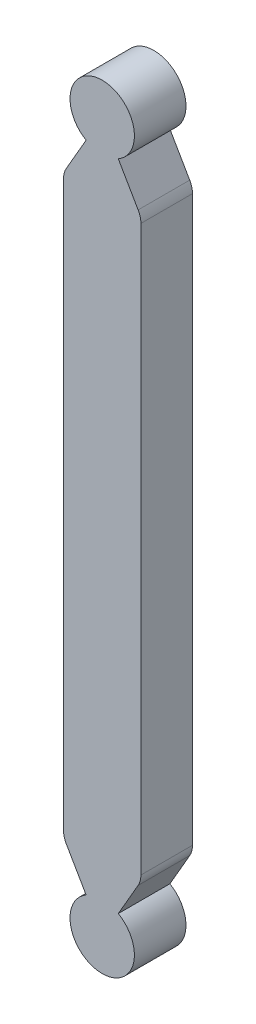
ISO-10303-21;
HEADER;
FILE_DESCRIPTION(('STEP AP214'),'2;1');
FILE_NAME('part.step','',(''),(''),'','','');
FILE_SCHEMA(('AUTOMOTIVE_DESIGN { 1 0 10303 214 1 1 1 1 }'));
ENDSEC;
DATA;
#1=APPLICATION_CONTEXT('core data for automotive mechanical design processes');
#2=APPLICATION_PROTOCOL_DEFINITION('international standard','automotive_design',2000,#1);
#3=PRODUCT_CONTEXT('',#1,'mechanical');
#4=PRODUCT('Part','Part','',(#3));
#5=PRODUCT_RELATED_PRODUCT_CATEGORY('part','',(#4));
#6=PRODUCT_DEFINITION_FORMATION('','',#4);
#7=PRODUCT_DEFINITION_CONTEXT('part definition',#1,'design');
#8=PRODUCT_DEFINITION('design','',#6,#7);
#9=PRODUCT_DEFINITION_SHAPE('','',#8);
#10=(LENGTH_UNIT() NAMED_UNIT(*) SI_UNIT(.MILLI.,.METRE.));
#11=(NAMED_UNIT(*) PLANE_ANGLE_UNIT() SI_UNIT($,.RADIAN.));
#12=(NAMED_UNIT(*) SI_UNIT($,.STERADIAN.) SOLID_ANGLE_UNIT());
#13=UNCERTAINTY_MEASURE_WITH_UNIT(LENGTH_MEASURE(1.E-05),#10,'distance_accuracy_value','');
#14=(GEOMETRIC_REPRESENTATION_CONTEXT(3) GLOBAL_UNCERTAINTY_ASSIGNED_CONTEXT((#13)) GLOBAL_UNIT_ASSIGNED_CONTEXT((#10,
#11,#12)) REPRESENTATION_CONTEXT('',''));
#15=CARTESIAN_POINT('',(0.,0.,0.));
#16=DIRECTION('',(0.,0.,1.));
#17=DIRECTION('',(1.,0.,0.));
#18=AXIS2_PLACEMENT_3D('',#15,#16,#17);
#19=CARTESIAN_POINT('',(-2.2225000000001,12.8918829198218,-3.175));
#20=DIRECTION('',(0.,0.,-1.));
#21=DIRECTION('',(-1.,0.,0.));
#22=AXIS2_PLACEMENT_3D('',#19,#20,#21);
#23=CYLINDRICAL_SURFACE('',#22,2.5399999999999);
#24=CARTESIAN_POINT('',(-2.2225000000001,12.8918829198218,3.175));
#25=DIRECTION('',(0.,0.,-1.));
#26=DIRECTION('',(-1.,0.,0.));
#27=AXIS2_PLACEMENT_3D('',#24,#25,#26);
#28=CIRCLE('',#27,2.5399999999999);
#29=CARTESIAN_POINT('',(-4.42220452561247,11.6218829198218,3.175));
#30=VERTEX_POINT('',#29);
#31=CARTESIAN_POINT('',(-4.7625,12.8918829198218,3.175));
#32=VERTEX_POINT('',#31);
#33=EDGE_CURVE('E122',#30,#32,#28,.T.);
#34=ORIENTED_EDGE('',*,*,#33,.T.);
#35=DIRECTION('',(0.,0.,-1.));
#36=VECTOR('',#35,1.);
#37=CARTESIAN_POINT('',(-4.7625,12.8918829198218,3.175));
#38=LINE('',#37,#36);
#39=CARTESIAN_POINT('',(-4.7625,12.8918829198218,-3.175));
#40=VERTEX_POINT('',#39);
#41=EDGE_CURVE('E120',#40,#32,#38,.F.);
#42=ORIENTED_EDGE('',*,*,#41,.F.);
#43=CARTESIAN_POINT('',(-2.2225000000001,12.8918829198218,-3.175));
#44=DIRECTION('',(0.,0.,-1.));
#45=DIRECTION('',(-1.,0.,0.));
#46=AXIS2_PLACEMENT_3D('',#43,#44,#45);
#47=CIRCLE('',#46,2.5399999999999);
#48=CARTESIAN_POINT('',(-4.42220452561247,11.6218829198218,-3.175));
#49=VERTEX_POINT('',#48);
#50=EDGE_CURVE('E29',#40,#49,#47,.F.);
#51=ORIENTED_EDGE('',*,*,#50,.T.);
#52=DIRECTION('',(0.,0.,-1.));
#53=VECTOR('',#52,1.);
#54=CARTESIAN_POINT('',(-4.42220452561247,11.6218829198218,3.175));
#55=LINE('',#54,#53);
#56=EDGE_CURVE('E117',#30,#49,#55,.T.);
#57=ORIENTED_EDGE('',*,*,#56,.F.);
#58=EDGE_LOOP('',(#34,#42,#51,#57));
#59=FACE_BOUND('',#58,.T.);
#60=ADVANCED_FACE('F25',(#59),#23,.T.);
#61=CARTESIAN_POINT('',(2.2225,12.8918829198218,-3.175));
#62=DIRECTION('',(0.,0.,-1.));
#63=DIRECTION('',(-1.,0.,0.));
#64=AXIS2_PLACEMENT_3D('',#61,#62,#63);
#65=CYLINDRICAL_SURFACE('',#64,2.54);
#66=CARTESIAN_POINT('',(2.2225,12.8918829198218,3.175));
#67=DIRECTION('',(0.,0.,-1.));
#68=DIRECTION('',(-1.,0.,0.));
#69=AXIS2_PLACEMENT_3D('',#66,#67,#68);
#70=CIRCLE('',#69,2.54);
#71=CARTESIAN_POINT('',(4.7625,12.8918829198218,3.175));
#72=VERTEX_POINT('',#71);
#73=CARTESIAN_POINT('',(4.42220452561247,11.6218829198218,3.175));
#74=VERTEX_POINT('',#73);
#75=EDGE_CURVE('E266',#72,#74,#70,.T.);
#76=ORIENTED_EDGE('',*,*,#75,.T.);
#77=DIRECTION('',(0.,0.,-1.));
#78=VECTOR('',#77,1.);
#79=CARTESIAN_POINT('',(4.42220452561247,11.6218829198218,3.175));
#80=LINE('',#79,#78);
#81=CARTESIAN_POINT('',(4.42220452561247,11.6218829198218,-3.175));
#82=VERTEX_POINT('',#81);
#83=EDGE_CURVE('E221',#82,#74,#80,.F.);
#84=ORIENTED_EDGE('',*,*,#83,.F.);
#85=CARTESIAN_POINT('',(2.2225,12.8918829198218,-3.175));
#86=DIRECTION('',(0.,0.,-1.));
#87=DIRECTION('',(-1.,0.,0.));
#88=AXIS2_PLACEMENT_3D('',#85,#86,#87);
#89=CIRCLE('',#88,2.54);
#90=CARTESIAN_POINT('',(4.7625,12.8918829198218,-3.175));
#91=VERTEX_POINT('',#90);
#92=EDGE_CURVE('E268',#82,#91,#89,.F.);
#93=ORIENTED_EDGE('',*,*,#92,.T.);
#94=DIRECTION('',(0.,0.,-1.));
#95=VECTOR('',#94,1.);
#96=CARTESIAN_POINT('',(4.7625,12.8918829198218,3.175));
#97=LINE('',#96,#95);
#98=EDGE_CURVE('E207',#72,#91,#97,.T.);
#99=ORIENTED_EDGE('',*,*,#98,.F.);
#100=EDGE_LOOP('',(#76,#84,#93,#99));
#101=FACE_BOUND('',#100,.T.);
#102=ADVANCED_FACE('F295',(#101),#65,.T.);
#103=CARTESIAN_POINT('',(2.22250000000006,82.3581170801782,-3.175));
#104=DIRECTION('',(0.,0.,-1.));
#105=DIRECTION('',(-1.,0.,0.));
#106=AXIS2_PLACEMENT_3D('',#103,#104,#105);
#107=CYLINDRICAL_SURFACE('',#106,2.53999999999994);
#108=CARTESIAN_POINT('',(2.22250000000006,82.3581170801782,3.175));
#109=DIRECTION('',(0.,0.,-1.));
#110=DIRECTION('',(-1.,0.,0.));
#111=AXIS2_PLACEMENT_3D('',#108,#109,#110);
#112=CIRCLE('',#111,2.53999999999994);
#113=CARTESIAN_POINT('',(4.42220452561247,83.6281170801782,3.175));
#114=VERTEX_POINT('',#113);
#115=CARTESIAN_POINT('',(4.7625,82.3581170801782,3.175));
#116=VERTEX_POINT('',#115);
#117=EDGE_CURVE('E262',#114,#116,#112,.T.);
#118=ORIENTED_EDGE('',*,*,#117,.T.);
#119=DIRECTION('',(0.,0.,-1.));
#120=VECTOR('',#119,1.);
#121=CARTESIAN_POINT('',(4.7625,82.3581170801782,3.175));
#122=LINE('',#121,#120);
#123=CARTESIAN_POINT('',(4.7625,82.3581170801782,-3.175));
#124=VERTEX_POINT('',#123);
#125=EDGE_CURVE('E220',#124,#116,#122,.F.);
#126=ORIENTED_EDGE('',*,*,#125,.F.);
#127=CARTESIAN_POINT('',(2.22250000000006,82.3581170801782,-3.175));
#128=DIRECTION('',(0.,0.,-1.));
#129=DIRECTION('',(-1.,0.,0.));
#130=AXIS2_PLACEMENT_3D('',#127,#128,#129);
#131=CIRCLE('',#130,2.53999999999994);
#132=CARTESIAN_POINT('',(4.42220452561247,83.6281170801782,-3.175));
#133=VERTEX_POINT('',#132);
#134=EDGE_CURVE('E264',#124,#133,#131,.F.);
#135=ORIENTED_EDGE('',*,*,#134,.T.);
#136=DIRECTION('',(0.,0.,-1.));
#137=VECTOR('',#136,1.);
#138=CARTESIAN_POINT('',(4.42220452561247,83.6281170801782,3.175));
#139=LINE('',#138,#137);
#140=EDGE_CURVE('E200',#114,#133,#139,.T.);
#141=ORIENTED_EDGE('',*,*,#140,.F.);
#142=EDGE_LOOP('',(#118,#126,#135,#141));
#143=FACE_BOUND('',#142,.T.);
#144=ADVANCED_FACE('F289',(#143),#107,.T.);
#145=CARTESIAN_POINT('',(-2.22250000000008,82.3581170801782,-3.175));
#146=DIRECTION('',(0.,0.,-1.));
#147=DIRECTION('',(-1.,0.,0.));
#148=AXIS2_PLACEMENT_3D('',#145,#146,#147);
#149=CYLINDRICAL_SURFACE('',#148,2.53999999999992);
#150=CARTESIAN_POINT('',(-2.22250000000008,82.3581170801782,3.175));
#151=DIRECTION('',(0.,0.,-1.));
#152=DIRECTION('',(-1.,0.,0.));
#153=AXIS2_PLACEMENT_3D('',#150,#151,#152);
#154=CIRCLE('',#153,2.53999999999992);
#155=CARTESIAN_POINT('',(-4.7625,82.3581170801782,3.175));
#156=VERTEX_POINT('',#155);
#157=CARTESIAN_POINT('',(-4.42220452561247,83.6281170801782,3.175));
#158=VERTEX_POINT('',#157);
#159=EDGE_CURVE('E243',#156,#158,#154,.T.);
#160=ORIENTED_EDGE('',*,*,#159,.T.);
#161=DIRECTION('',(0.,0.,-1.));
#162=VECTOR('',#161,1.);
#163=CARTESIAN_POINT('',(-4.42220452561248,83.6281170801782,3.175));
#164=LINE('',#163,#162);
#165=CARTESIAN_POINT('',(-4.42220452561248,83.6281170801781,-3.175));
#166=VERTEX_POINT('',#165);
#167=EDGE_CURVE('E140',#166,#158,#164,.F.);
#168=ORIENTED_EDGE('',*,*,#167,.F.);
#169=CARTESIAN_POINT('',(-2.22250000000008,82.3581170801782,-3.175));
#170=DIRECTION('',(0.,0.,-1.));
#171=DIRECTION('',(-1.,0.,0.));
#172=AXIS2_PLACEMENT_3D('',#169,#170,#171);
#173=CIRCLE('',#172,2.53999999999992);
#174=CARTESIAN_POINT('',(-4.7625,82.3581170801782,-3.175));
#175=VERTEX_POINT('',#174);
#176=EDGE_CURVE('E233',#175,#166,#173,.T.);
#177=ORIENTED_EDGE('',*,*,#176,.F.);
#178=DIRECTION('',(0.,0.,-1.));
#179=VECTOR('',#178,1.);
#180=CARTESIAN_POINT('',(-4.7625,82.3581170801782,3.175));
#181=LINE('',#180,#179);
#182=EDGE_CURVE('E132',#156,#175,#181,.T.);
#183=ORIENTED_EDGE('',*,*,#182,.F.);
#184=EDGE_LOOP('',(#160,#168,#177,#183));
#185=FACE_BOUND('',#184,.T.);
#186=ADVANCED_FACE('F277',(#185),#149,.T.);
#187=CARTESIAN_POINT('',(-4.7625,12.8918829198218,3.175));
#188=DIRECTION('',(-1.,0.,0.));
#189=DIRECTION('',(0.,1.,0.));
#190=AXIS2_PLACEMENT_3D('',#187,#188,#189);
#191=PLANE('',#190);
#192=DIRECTION('',(0.,1.,0.));
#193=VECTOR('',#192,1.);
#194=CARTESIAN_POINT('',(-4.7625,0.,3.175));
#195=LINE('',#194,#193);
#196=EDGE_CURVE('E244',#156,#32,#195,.F.);
#197=ORIENTED_EDGE('',*,*,#196,.F.);
#198=ORIENTED_EDGE('',*,*,#182,.T.);
#199=DIRECTION('',(0.,1.,0.));
#200=VECTOR('',#199,1.);
#201=CARTESIAN_POINT('',(-4.7625,0.,-3.175));
#202=LINE('',#201,#200);
#203=EDGE_CURVE('E234',#40,#175,#202,.T.);
#204=ORIENTED_EDGE('',*,*,#203,.F.);
#205=ORIENTED_EDGE('',*,*,#41,.T.);
#206=EDGE_LOOP('',(#197,#198,#204,#205));
#207=FACE_BOUND('',#206,.T.);
#208=ADVANCED_FACE('F272',(#207),#191,.T.);
#209=CARTESIAN_POINT('',(-1.9812,7.39393905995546,3.175));
#210=DIRECTION('',(-0.866025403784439,-0.499999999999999,0.));
#211=DIRECTION('',(-0.499999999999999,0.866025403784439,0.));
#212=AXIS2_PLACEMENT_3D('',#209,#210,#211);
#213=PLANE('',#212);
#214=CARTESIAN_POINT('',(-4.42220452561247,11.6218829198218,3.175));
#215=CARTESIAN_POINT('',(-4.32049600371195,11.4457185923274,3.175));
#216=CARTESIAN_POINT('',(-4.21878748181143,11.269554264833,3.175));
#217=CARTESIAN_POINT('',(-4.01537043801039,10.9172256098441,3.175));
#218=CARTESIAN_POINT('',(-3.91366191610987,10.7410612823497,3.175));
#219=CARTESIAN_POINT('',(-3.71024487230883,10.3887326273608,3.175));
#220=CARTESIAN_POINT('',(-3.60853635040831,10.2125682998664,3.175));
#221=CARTESIAN_POINT('',(-3.40511930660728,9.8602396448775,3.175));
#222=CARTESIAN_POINT('',(-3.30341078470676,9.68407531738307,3.175));
#223=CARTESIAN_POINT('',(-3.09999374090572,9.33174666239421,3.175));
#224=CARTESIAN_POINT('',(-2.9982852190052,9.15558233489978,3.175));
#225=CARTESIAN_POINT('',(-2.79486817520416,8.80325367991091,3.175));
#226=CARTESIAN_POINT('',(-2.69315965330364,8.62708935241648,3.175));
#227=CARTESIAN_POINT('',(-2.4897426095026,8.27476069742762,3.175));
#228=CARTESIAN_POINT('',(-2.38803408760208,8.09859636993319,3.175));
#229=CARTESIAN_POINT('',(-2.18461704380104,7.74626771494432,3.175));
#230=CARTESIAN_POINT('',(-2.08290852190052,7.57010338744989,3.175));
#231=CARTESIAN_POINT('',(-1.9812,7.39393905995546,3.175));
#232=B_SPLINE_CURVE_WITH_KNOTS('',3,(#214,#215,#216,#217,#218,#219,#220,#221,#222,#223,#224,
#225,#226,#227,#228,#229,#230,#231),.UNSPECIFIED.,.F.,.F.,(4,2,2,2,2,2,2,2,4),(0.,
0.610251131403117,1.22050226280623,1.83075339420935,2.44100452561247,3.05125565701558,
3.6615067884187,4.27175791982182,4.88200905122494),.UNSPECIFIED.);
#233=CARTESIAN_POINT('',(-1.9812,7.39393905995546,3.175));
#234=VERTEX_POINT('',#233);
#235=EDGE_CURVE('E130',#30,#234,#232,.T.);
#236=ORIENTED_EDGE('',*,*,#235,.F.);
#237=ORIENTED_EDGE('',*,*,#56,.T.);
#238=CARTESIAN_POINT('',(-1.9812,7.39393905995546,-3.175));
#239=CARTESIAN_POINT('',(-2.08290852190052,7.57010338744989,-3.175));
#240=CARTESIAN_POINT('',(-2.18461704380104,7.74626771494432,-3.175));
#241=CARTESIAN_POINT('',(-2.38803408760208,8.09859636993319,-3.175));
#242=CARTESIAN_POINT('',(-2.4897426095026,8.27476069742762,-3.175));
#243=CARTESIAN_POINT('',(-2.69315965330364,8.62708935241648,-3.175));
#244=CARTESIAN_POINT('',(-2.79486817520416,8.80325367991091,-3.175));
#245=CARTESIAN_POINT('',(-2.9982852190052,9.15558233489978,-3.175));
#246=CARTESIAN_POINT('',(-3.09999374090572,9.33174666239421,-3.175));
#247=CARTESIAN_POINT('',(-3.30341078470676,9.68407531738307,-3.175));
#248=CARTESIAN_POINT('',(-3.40511930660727,9.8602396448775,-3.175));
#249=CARTESIAN_POINT('',(-3.60853635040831,10.2125682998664,-3.175));
#250=CARTESIAN_POINT('',(-3.71024487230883,10.3887326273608,-3.175));
#251=CARTESIAN_POINT('',(-3.91366191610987,10.7410612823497,-3.175));
#252=CARTESIAN_POINT('',(-4.01537043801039,10.9172256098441,-3.175));
#253=CARTESIAN_POINT('',(-4.21878748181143,11.269554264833,-3.175));
#254=CARTESIAN_POINT('',(-4.32049600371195,11.4457185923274,-3.175));
#255=CARTESIAN_POINT('',(-4.42220452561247,11.6218829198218,-3.175));
#256=B_SPLINE_CURVE_WITH_KNOTS('',3,(#238,#239,#240,#241,#242,#243,#244,#245,#246,#247,#248,
#249,#250,#251,#252,#253,#254,#255),.UNSPECIFIED.,.F.,.F.,(4,2,2,2,2,2,2,2,4),(0.,
0.610251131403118,1.22050226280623,1.83075339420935,2.44100452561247,3.05125565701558,
3.6615067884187,4.27175791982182,4.88200905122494),.UNSPECIFIED.);
#257=CARTESIAN_POINT('',(-1.9812,7.39393905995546,-3.175));
#258=VERTEX_POINT('',#257);
#259=EDGE_CURVE('E127',#258,#49,#256,.T.);
#260=ORIENTED_EDGE('',*,*,#259,.F.);
#261=DIRECTION('',(0.,0.,-1.));
#262=VECTOR('',#261,1.);
#263=CARTESIAN_POINT('',(-1.9812,7.39393905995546,0.));
#264=LINE('',#263,#262);
#265=EDGE_CURVE('E131',#234,#258,#264,.T.);
#266=ORIENTED_EDGE('',*,*,#265,.F.);
#267=EDGE_LOOP('',(#236,#237,#260,#266));
#268=FACE_BOUND('',#267,.T.);
#269=ADVANCED_FACE('F125',(#268),#213,.T.);
#270=CARTESIAN_POINT('',(0.,3.9624,-3.175));
#271=DIRECTION('',(0.,0.,-1.));
#272=DIRECTION('',(-1.,0.,0.));
#273=AXIS2_PLACEMENT_3D('',#270,#271,#272);
#274=CYLINDRICAL_SURFACE('',#273,3.9624);
#275=DIRECTION('',(0.,0.,-1.));
#276=VECTOR('',#275,1.);
#277=CARTESIAN_POINT('',(1.9812,7.39393905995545,3.175));
#278=LINE('',#277,#276);
#279=CARTESIAN_POINT('',(1.9812,7.39393905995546,3.175));
#280=VERTEX_POINT('',#279);
#281=CARTESIAN_POINT('',(1.9812,7.39393905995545,-3.175));
#282=VERTEX_POINT('',#281);
#283=EDGE_CURVE('E213',#280,#282,#278,.T.);
#284=ORIENTED_EDGE('',*,*,#283,.F.);
#285=CARTESIAN_POINT('',(0.,3.9624,3.175));
#286=DIRECTION('',(0.,0.,-1.));
#287=DIRECTION('',(-1.,0.,0.));
#288=AXIS2_PLACEMENT_3D('',#285,#286,#287);
#289=CIRCLE('',#288,3.9624);
#290=EDGE_CURVE('E212',#234,#280,#289,.F.);
#291=ORIENTED_EDGE('',*,*,#290,.F.);
#292=ORIENTED_EDGE('',*,*,#265,.T.);
#293=CARTESIAN_POINT('',(0.,3.9624,-3.175));
#294=DIRECTION('',(0.,0.,-1.));
#295=DIRECTION('',(-1.,0.,0.));
#296=AXIS2_PLACEMENT_3D('',#293,#294,#295);
#297=CIRCLE('',#296,3.9624);
#298=EDGE_CURVE('E136',#282,#258,#297,.T.);
#299=ORIENTED_EDGE('',*,*,#298,.F.);
#300=EDGE_LOOP('',(#284,#291,#292,#299));
#301=FACE_BOUND('',#300,.T.);
#302=ADVANCED_FACE('F297',(#301),#274,.T.);
#303=CARTESIAN_POINT('',(4.42220452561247,11.6218829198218,3.175));
#304=DIRECTION('',(0.866025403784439,-0.499999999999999,0.));
#305=DIRECTION('',(-0.499999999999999,-0.866025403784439,0.));
#306=AXIS2_PLACEMENT_3D('',#303,#304,#305);
#307=PLANE('',#306);
#308=CARTESIAN_POINT('',(1.9812,7.39393905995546,3.175));
#309=CARTESIAN_POINT('',(2.08290852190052,7.57010338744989,3.175));
#310=CARTESIAN_POINT('',(2.18461704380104,7.74626771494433,3.175));
#311=CARTESIAN_POINT('',(2.38803408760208,8.09859636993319,3.175));
#312=CARTESIAN_POINT('',(2.4897426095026,8.27476069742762,3.175));
#313=CARTESIAN_POINT('',(2.69315965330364,8.62708935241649,3.175));
#314=CARTESIAN_POINT('',(2.79486817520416,8.80325367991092,3.175));
#315=CARTESIAN_POINT('',(2.9982852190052,9.15558233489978,3.175));
#316=CARTESIAN_POINT('',(3.09999374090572,9.33174666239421,3.175));
#317=CARTESIAN_POINT('',(3.30341078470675,9.68407531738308,3.175));
#318=CARTESIAN_POINT('',(3.40511930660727,9.86023964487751,3.175));
#319=CARTESIAN_POINT('',(3.60853635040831,10.2125682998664,3.175));
#320=CARTESIAN_POINT('',(3.71024487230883,10.3887326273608,3.175));
#321=CARTESIAN_POINT('',(3.91366191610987,10.7410612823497,3.175));
#322=CARTESIAN_POINT('',(4.01537043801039,10.9172256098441,3.175));
#323=CARTESIAN_POINT('',(4.21878748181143,11.269554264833,3.175));
#324=CARTESIAN_POINT('',(4.32049600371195,11.4457185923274,3.175));
#325=CARTESIAN_POINT('',(4.42220452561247,11.6218829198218,3.175));
#326=B_SPLINE_CURVE_WITH_KNOTS('',3,(#308,#309,#310,#311,#312,#313,#314,#315,#316,#317,#318,
#319,#320,#321,#322,#323,#324,#325),.UNSPECIFIED.,.F.,.F.,(4,2,2,2,2,2,2,2,4),(0.,
0.610251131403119,1.22050226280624,1.83075339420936,2.44100452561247,3.05125565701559,
3.66150678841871,4.27175791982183,4.88200905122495),.UNSPECIFIED.);
#327=EDGE_CURVE('E208',#280,#74,#326,.T.);
#328=ORIENTED_EDGE('',*,*,#327,.F.);
#329=ORIENTED_EDGE('',*,*,#283,.T.);
#330=CARTESIAN_POINT('',(4.42220452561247,11.6218829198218,-3.175));
#331=CARTESIAN_POINT('',(4.32049600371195,11.4457185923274,-3.175));
#332=CARTESIAN_POINT('',(4.21878748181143,11.269554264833,-3.175));
#333=CARTESIAN_POINT('',(4.01537043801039,10.9172256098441,-3.175));
#334=CARTESIAN_POINT('',(3.91366191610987,10.7410612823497,-3.175));
#335=CARTESIAN_POINT('',(3.71024487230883,10.3887326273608,-3.175));
#336=CARTESIAN_POINT('',(3.60853635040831,10.2125682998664,-3.175));
#337=CARTESIAN_POINT('',(3.40511930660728,9.86023964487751,-3.175));
#338=CARTESIAN_POINT('',(3.30341078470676,9.68407531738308,-3.175));
#339=CARTESIAN_POINT('',(3.09999374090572,9.33174666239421,-3.175));
#340=CARTESIAN_POINT('',(2.9982852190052,9.15558233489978,-3.175));
#341=CARTESIAN_POINT('',(2.79486817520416,8.80325367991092,-3.175));
#342=CARTESIAN_POINT('',(2.69315965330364,8.62708935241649,-3.175));
#343=CARTESIAN_POINT('',(2.4897426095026,8.27476069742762,-3.175));
#344=CARTESIAN_POINT('',(2.38803408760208,8.09859636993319,-3.175));
#345=CARTESIAN_POINT('',(2.18461704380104,7.74626771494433,-3.175));
#346=CARTESIAN_POINT('',(2.08290852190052,7.57010338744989,-3.175));
#347=CARTESIAN_POINT('',(1.9812,7.39393905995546,-3.175));
#348=B_SPLINE_CURVE_WITH_KNOTS('',3,(#330,#331,#332,#333,#334,#335,#336,#337,#338,#339,#340,
#341,#342,#343,#344,#345,#346,#347),.UNSPECIFIED.,.F.,.F.,(4,2,2,2,2,2,2,2,4),(0.,
0.610251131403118,1.22050226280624,1.83075339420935,2.44100452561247,3.05125565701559,
3.66150678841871,4.27175791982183,4.88200905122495),.UNSPECIFIED.);
#349=EDGE_CURVE('E142',#82,#282,#348,.T.);
#350=ORIENTED_EDGE('',*,*,#349,.F.);
#351=ORIENTED_EDGE('',*,*,#83,.T.);
#352=EDGE_LOOP('',(#328,#329,#350,#351));
#353=FACE_BOUND('',#352,.T.);
#354=ADVANCED_FACE('F296',(#353),#307,.T.);
#355=CARTESIAN_POINT('',(4.7625,82.3581170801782,3.175));
#356=DIRECTION('',(1.,0.,0.));
#357=DIRECTION('',(0.,-1.,0.));
#358=AXIS2_PLACEMENT_3D('',#355,#356,#357);
#359=PLANE('',#358);
#360=DIRECTION('',(0.,1.,0.));
#361=VECTOR('',#360,1.);
#362=CARTESIAN_POINT('',(4.7625,0.,3.175));
#363=LINE('',#362,#361);
#364=EDGE_CURVE('E197',#72,#116,#363,.T.);
#365=ORIENTED_EDGE('',*,*,#364,.F.);
#366=ORIENTED_EDGE('',*,*,#98,.T.);
#367=DIRECTION('',(0.,1.,0.));
#368=VECTOR('',#367,1.);
#369=CARTESIAN_POINT('',(4.7625,0.,-3.175));
#370=LINE('',#369,#368);
#371=EDGE_CURVE('E232',#124,#91,#370,.F.);
#372=ORIENTED_EDGE('',*,*,#371,.F.);
#373=ORIENTED_EDGE('',*,*,#125,.T.);
#374=EDGE_LOOP('',(#365,#366,#372,#373));
#375=FACE_BOUND('',#374,.T.);
#376=ADVANCED_FACE('F292',(#375),#359,.T.);
#377=CARTESIAN_POINT('',(1.9812,87.8560609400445,3.175));
#378=DIRECTION('',(0.866025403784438,0.500000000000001,0.));
#379=DIRECTION('',(0.500000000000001,-0.866025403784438,0.));
#380=AXIS2_PLACEMENT_3D('',#377,#378,#379);
#381=PLANE('',#380);
#382=CARTESIAN_POINT('',(4.42220452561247,83.6281170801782,3.175));
#383=CARTESIAN_POINT('',(4.32049600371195,83.8042814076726,3.175));
#384=CARTESIAN_POINT('',(4.21878748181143,83.980445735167,3.175));
#385=CARTESIAN_POINT('',(4.01537043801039,84.3327743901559,3.175));
#386=CARTESIAN_POINT('',(3.91366191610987,84.5089387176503,3.175));
#387=CARTESIAN_POINT('',(3.71024487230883,84.8612673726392,3.175));
#388=CARTESIAN_POINT('',(3.60853635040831,85.0374317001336,3.175));
#389=CARTESIAN_POINT('',(3.40511930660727,85.3897603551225,3.175));
#390=CARTESIAN_POINT('',(3.30341078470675,85.5659246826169,3.175));
#391=CARTESIAN_POINT('',(3.09999374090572,85.9182533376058,3.175));
#392=CARTESIAN_POINT('',(2.9982852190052,86.0944176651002,3.175));
#393=CARTESIAN_POINT('',(2.79486817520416,86.4467463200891,3.175));
#394=CARTESIAN_POINT('',(2.69315965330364,86.6229106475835,3.175));
#395=CARTESIAN_POINT('',(2.4897426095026,86.9752393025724,3.175));
#396=CARTESIAN_POINT('',(2.38803408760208,87.1514036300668,3.175));
#397=CARTESIAN_POINT('',(2.18461704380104,87.5037322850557,3.175));
#398=CARTESIAN_POINT('',(2.08290852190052,87.6798966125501,3.175));
#399=CARTESIAN_POINT('',(1.9812,87.8560609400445,3.175));
#400=B_SPLINE_CURVE_WITH_KNOTS('',3,(#382,#383,#384,#385,#386,#387,#388,#389,#390,#391,#392,
#393,#394,#395,#396,#397,#398,#399),.UNSPECIFIED.,.F.,.F.,(4,2,2,2,2,2,2,2,4),(0.,
0.610251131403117,1.22050226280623,1.83075339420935,2.44100452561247,3.05125565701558,
3.6615067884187,4.27175791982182,4.88200905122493),.UNSPECIFIED.);
#401=CARTESIAN_POINT('',(1.9812,87.8560609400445,3.175));
#402=VERTEX_POINT('',#401);
#403=EDGE_CURVE('E192',#114,#402,#400,.T.);
#404=ORIENTED_EDGE('',*,*,#403,.F.);
#405=ORIENTED_EDGE('',*,*,#140,.T.);
#406=CARTESIAN_POINT('',(1.9812,87.8560609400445,-3.175));
#407=CARTESIAN_POINT('',(2.08290852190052,87.6798966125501,-3.175));
#408=CARTESIAN_POINT('',(2.18461704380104,87.5037322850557,-3.175));
#409=CARTESIAN_POINT('',(2.38803408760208,87.1514036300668,-3.175));
#410=CARTESIAN_POINT('',(2.4897426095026,86.9752393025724,-3.175));
#411=CARTESIAN_POINT('',(2.69315965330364,86.6229106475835,-3.175));
#412=CARTESIAN_POINT('',(2.79486817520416,86.4467463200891,-3.175));
#413=CARTESIAN_POINT('',(2.9982852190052,86.0944176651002,-3.175));
#414=CARTESIAN_POINT('',(3.09999374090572,85.9182533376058,-3.175));
#415=CARTESIAN_POINT('',(3.30341078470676,85.5659246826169,-3.175));
#416=CARTESIAN_POINT('',(3.40511930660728,85.3897603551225,-3.175));
#417=CARTESIAN_POINT('',(3.60853635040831,85.0374317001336,-3.175));
#418=CARTESIAN_POINT('',(3.71024487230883,84.8612673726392,-3.175));
#419=CARTESIAN_POINT('',(3.91366191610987,84.5089387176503,-3.175));
#420=CARTESIAN_POINT('',(4.01537043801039,84.3327743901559,-3.175));
#421=CARTESIAN_POINT('',(4.21878748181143,83.980445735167,-3.175));
#422=CARTESIAN_POINT('',(4.32049600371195,83.8042814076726,-3.175));
#423=CARTESIAN_POINT('',(4.42220452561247,83.6281170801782,-3.175));
#424=B_SPLINE_CURVE_WITH_KNOTS('',3,(#406,#407,#408,#409,#410,#411,#412,#413,#414,#415,#416,
#417,#418,#419,#420,#421,#422,#423),.UNSPECIFIED.,.F.,.F.,(4,2,2,2,2,2,2,2,4),(0.,
0.610251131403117,1.22050226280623,1.83075339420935,2.44100452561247,3.05125565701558,
3.6615067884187,4.27175791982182,4.88200905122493),.UNSPECIFIED.);
#425=CARTESIAN_POINT('',(1.9812,87.8560609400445,-3.175));
#426=VERTEX_POINT('',#425);
#427=EDGE_CURVE('E228',#426,#133,#424,.T.);
#428=ORIENTED_EDGE('',*,*,#427,.F.);
#429=DIRECTION('',(0.,0.,-1.));
#430=VECTOR('',#429,1.);
#431=CARTESIAN_POINT('',(1.9812,87.8560609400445,0.));
#432=LINE('',#431,#430);
#433=EDGE_CURVE('E198',#402,#426,#432,.T.);
#434=ORIENTED_EDGE('',*,*,#433,.F.);
#435=EDGE_LOOP('',(#404,#405,#428,#434));
#436=FACE_BOUND('',#435,.T.);
#437=ADVANCED_FACE('F159',(#436),#381,.T.);
#438=CARTESIAN_POINT('',(4.7625,-0.629917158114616,-3.175));
#439=DIRECTION('',(0.,0.,-1.));
#440=DIRECTION('',(-1.,0.,0.));
#441=AXIS2_PLACEMENT_3D('',#438,#439,#440);
#442=PLANE('',#441);
#443=ORIENTED_EDGE('',*,*,#298,.T.);
#444=ORIENTED_EDGE('',*,*,#259,.T.);
#445=ORIENTED_EDGE('',*,*,#50,.F.);
#446=ORIENTED_EDGE('',*,*,#203,.T.);
#447=ORIENTED_EDGE('',*,*,#176,.T.);
#448=DIRECTION('',(-0.5,-0.866025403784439,0.));
#449=VECTOR('',#448,1.);
#450=CARTESIAN_POINT('',(-3.20170226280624,85.7420890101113,-3.175));
#451=LINE('',#450,#449);
#452=CARTESIAN_POINT('',(-1.98120000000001,87.8560609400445,-3.175));
#453=VERTEX_POINT('',#452);
#454=EDGE_CURVE('E137',#453,#166,#451,.T.);
#455=ORIENTED_EDGE('',*,*,#454,.F.);
#456=CARTESIAN_POINT('',(0.,91.2876,-3.175));
#457=DIRECTION('',(0.,0.,-1.));
#458=DIRECTION('',(-1.,0.,0.));
#459=AXIS2_PLACEMENT_3D('',#456,#457,#458);
#460=CIRCLE('',#459,3.96240000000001);
#461=EDGE_CURVE('E255',#426,#453,#460,.F.);
#462=ORIENTED_EDGE('',*,*,#461,.F.);
#463=ORIENTED_EDGE('',*,*,#427,.T.);
#464=ORIENTED_EDGE('',*,*,#134,.F.);
#465=ORIENTED_EDGE('',*,*,#371,.T.);
#466=ORIENTED_EDGE('',*,*,#92,.F.);
#467=ORIENTED_EDGE('',*,*,#349,.T.);
#468=EDGE_LOOP('',(#443,#444,#445,#446,#447,#455,#462,#463,#464,#465,#466,#467));
#469=FACE_BOUND('',#468,.T.);
#470=ADVANCED_FACE('F134',(#469),#442,.T.);
#471=CARTESIAN_POINT('',(-4.42220452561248,83.6281170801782,3.175));
#472=DIRECTION('',(-0.866025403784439,0.5,0.));
#473=DIRECTION('',(0.5,0.866025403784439,0.));
#474=AXIS2_PLACEMENT_3D('',#471,#472,#473);
#475=PLANE('',#474);
#476=CARTESIAN_POINT('',(-1.9812,87.8560609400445,3.175));
#477=CARTESIAN_POINT('',(-2.08290852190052,87.6798966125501,3.175));
#478=CARTESIAN_POINT('',(-2.18461704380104,87.5037322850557,3.175));
#479=CARTESIAN_POINT('',(-2.38803408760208,87.1514036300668,3.175));
#480=CARTESIAN_POINT('',(-2.4897426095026,86.9752393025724,3.175));
#481=CARTESIAN_POINT('',(-2.69315965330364,86.6229106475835,3.175));
#482=CARTESIAN_POINT('',(-2.79486817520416,86.4467463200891,3.175));
#483=CARTESIAN_POINT('',(-2.9982852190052,86.0944176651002,3.175));
#484=CARTESIAN_POINT('',(-3.09999374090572,85.9182533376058,3.175));
#485=CARTESIAN_POINT('',(-3.30341078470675,85.5659246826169,3.175));
#486=CARTESIAN_POINT('',(-3.40511930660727,85.3897603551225,3.175));
#487=CARTESIAN_POINT('',(-3.60853635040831,85.0374317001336,3.175));
#488=CARTESIAN_POINT('',(-3.71024487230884,84.8612673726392,3.175));
#489=CARTESIAN_POINT('',(-3.91366191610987,84.5089387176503,3.175));
#490=CARTESIAN_POINT('',(-4.01537043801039,84.3327743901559,3.175));
#491=CARTESIAN_POINT('',(-4.21878748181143,83.980445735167,3.175));
#492=CARTESIAN_POINT('',(-4.32049600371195,83.8042814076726,3.175));
#493=CARTESIAN_POINT('',(-4.42220452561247,83.6281170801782,3.175));
#494=B_SPLINE_CURVE_WITH_KNOTS('',3,(#476,#477,#478,#479,#480,#481,#482,#483,#484,#485,#486,
#487,#488,#489,#490,#491,#492,#493),.UNSPECIFIED.,.F.,.F.,(4,2,2,2,2,2,2,2,4),(0.,
0.610251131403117,1.22050226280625,1.83075339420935,2.44100452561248,3.0512556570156,
3.6615067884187,4.27175791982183,4.88200905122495),.UNSPECIFIED.);
#495=CARTESIAN_POINT('',(-1.98120000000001,87.8560609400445,3.175));
#496=VERTEX_POINT('',#495);
#497=EDGE_CURVE('E44',#496,#158,#494,.T.);
#498=ORIENTED_EDGE('',*,*,#497,.F.);
#499=DIRECTION('',(0.,0.,1.));
#500=VECTOR('',#499,1.);
#501=CARTESIAN_POINT('',(-1.98120000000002,87.8560609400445,0.));
#502=LINE('',#501,#500);
#503=EDGE_CURVE('E35',#453,#496,#502,.T.);
#504=ORIENTED_EDGE('',*,*,#503,.F.);
#505=ORIENTED_EDGE('',*,*,#454,.T.);
#506=ORIENTED_EDGE('',*,*,#167,.T.);
#507=EDGE_LOOP('',(#498,#504,#505,#506));
#508=FACE_BOUND('',#507,.T.);
#509=ADVANCED_FACE('F182',(#508),#475,.T.);
#510=CARTESIAN_POINT('',(-4.7625,-0.586315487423,3.175));
#511=DIRECTION('',(0.,0.,1.));
#512=DIRECTION('',(1.,0.,0.));
#513=AXIS2_PLACEMENT_3D('',#510,#511,#512);
#514=PLANE('',#513);
#515=ORIENTED_EDGE('',*,*,#497,.T.);
#516=ORIENTED_EDGE('',*,*,#159,.F.);
#517=ORIENTED_EDGE('',*,*,#196,.T.);
#518=ORIENTED_EDGE('',*,*,#33,.F.);
#519=ORIENTED_EDGE('',*,*,#235,.T.);
#520=ORIENTED_EDGE('',*,*,#290,.T.);
#521=ORIENTED_EDGE('',*,*,#327,.T.);
#522=ORIENTED_EDGE('',*,*,#75,.F.);
#523=ORIENTED_EDGE('',*,*,#364,.T.);
#524=ORIENTED_EDGE('',*,*,#117,.F.);
#525=ORIENTED_EDGE('',*,*,#403,.T.);
#526=CARTESIAN_POINT('',(0.,91.2876,3.175));
#527=DIRECTION('',(0.,0.,-1.));
#528=DIRECTION('',(-1.,0.,0.));
#529=AXIS2_PLACEMENT_3D('',#526,#527,#528);
#530=CIRCLE('',#529,3.96240000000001);
#531=EDGE_CURVE('E13',#496,#402,#530,.T.);
#532=ORIENTED_EDGE('',*,*,#531,.F.);
#533=EDGE_LOOP('',(#515,#516,#517,#518,#519,#520,#521,#522,#523,#524,#525,#532));
#534=FACE_BOUND('',#533,.T.);
#535=ADVANCED_FACE('F183',(#534),#514,.T.);
#536=CARTESIAN_POINT('',(0.,91.2876,-3.175));
#537=DIRECTION('',(0.,0.,-1.));
#538=DIRECTION('',(-1.,0.,0.));
#539=AXIS2_PLACEMENT_3D('',#536,#537,#538);
#540=CYLINDRICAL_SURFACE('',#539,3.96240000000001);
#541=ORIENTED_EDGE('',*,*,#503,.T.);
#542=ORIENTED_EDGE('',*,*,#531,.T.);
#543=ORIENTED_EDGE('',*,*,#433,.T.);
#544=ORIENTED_EDGE('',*,*,#461,.T.);
#545=EDGE_LOOP('',(#541,#542,#543,#544));
#546=FACE_BOUND('',#545,.T.);
#547=ADVANCED_FACE('F27',(#546),#540,.T.);
#548=CLOSED_SHELL('',(#60,#102,#144,#186,#208,#269,#302,#354,#376,#437,#470,#509,#535,#547));
#549=MANIFOLD_SOLID_BREP('B1',#548);
#550=ADVANCED_BREP_SHAPE_REPRESENTATION('',(#18,#549),#14);
#551=SHAPE_DEFINITION_REPRESENTATION(#9,#550);
ENDSEC;
END-ISO-10303-21;
